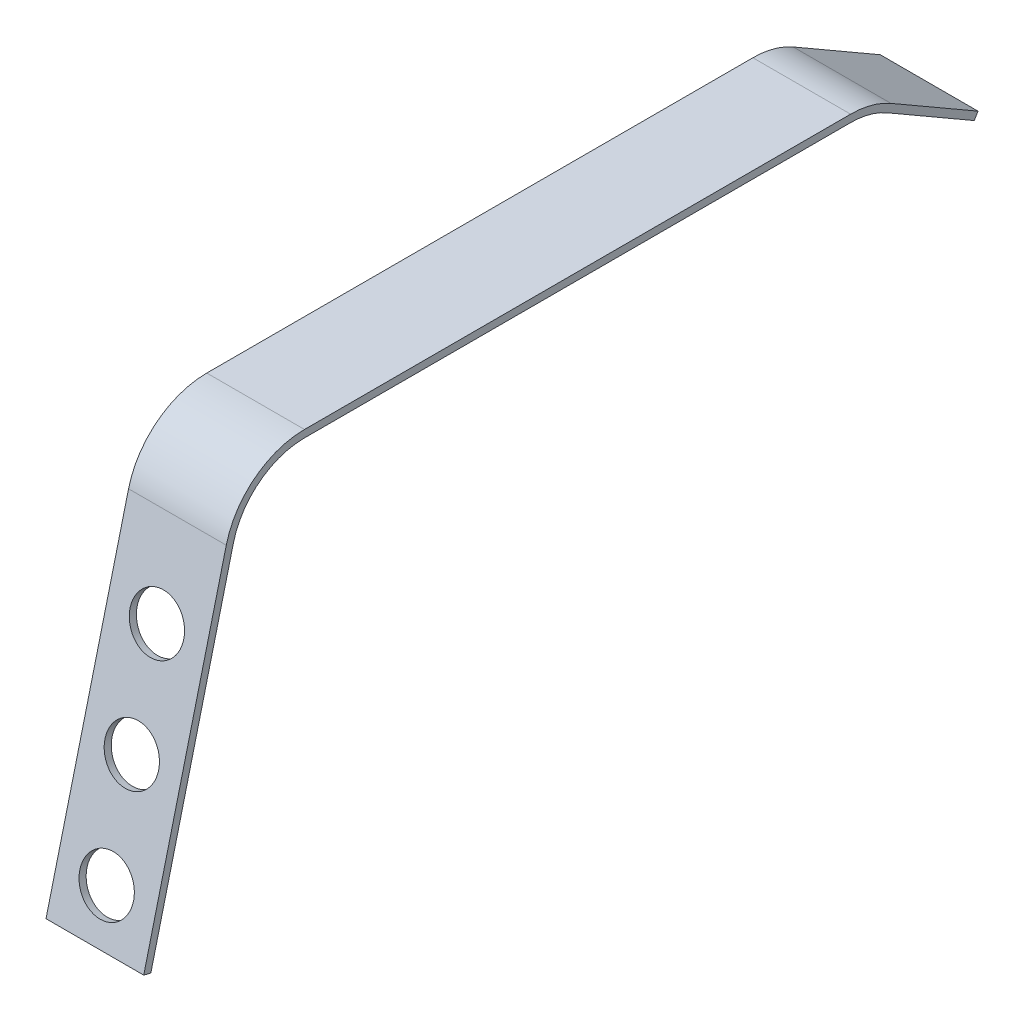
from build123d import *

# Parameters (mm, degrees)
EXTRUDE_5_DEPTH     = 4
SKETCH_11_R         = 1.1
CUT_EXTRUDE_6_DEPTH = 34.149511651
EXTRUDE_6_DEPTH     = 4
FILLET_6_R          = 3
FILLET_5_R          = 3.3
SKETCH_13_W         = 4.815621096
SKETCH_13_H         = 0.3
EXTRUDE_7_DEPTH     = 4
SKETCH_14_W         = 4.305758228
SKETCH_14_H         = 1.830785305
CUT_EXTRUDE_7_DEPTH = 35.133970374
EXTRUDE_12_DEPTH    = 4
CUT_EXTRUDE_8_DEPTH = 35.133970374


with BuildPart() as part:
    # Sketch 10 → Extrude 5 (new body)
    with BuildSketch(Plane(origin=(0, 0, 0), x_dir=(0, 0, -1), z_dir=(1, 0, 0))):
        with BuildLine():
            Line((-25.681090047, 0.539574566), (-29.817954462, -16.052482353))
            Line((-29.817954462, -16.052482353), (-29.526865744, -16.125058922))
            Line((-29.526865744, -16.125058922), (-25.390001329, 0.466997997))
            ThreePointArc((-25.390001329, 0.466997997), (-25.253424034, 0.651571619), (-25.026336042, 0.685510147))
            Line((-25.026336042, 0.685510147), (-21.145153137, -0.282177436))
            ThreePointArc((-21.145153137, -0.282177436), (-21.073121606, -0.295527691), (-21, -0.3))
            Line((-21, -0.3), (0, -0.3))
            Line((0, -0.3), (0, 0))
            Line((0, 0), (-21, 0))
            ThreePointArc((-21, 0), (-21.036560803, 0.002236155), (-21.072576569, 0.008911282))
            Line((-21.072576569, 0.008911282), (-24.953759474, 0.976598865))
            ThreePointArc((-24.953759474, 0.976598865), (-25.407935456, 0.908721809), (-25.681090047, 0.539574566))
        make_face()
    extrude(amount=EXTRUDE_5_DEPTH)

    # Sketch 11 → Cut-Extrude 6 (cut, through all)
    with BuildSketch(Plane(origin=(0, 6.05984999, 24.3047308), x_dir=(1, 0, 0), z_dir=(0, 0.24192189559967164, 0.9702957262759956))):
        with Locations(Location((2, -20.78927109, 0), (0, 0, 270))):
            Circle(SKETCH_11_R)
        with Locations(Location((2, -12.28927109, 0), (0, 0, 270))):
            Circle(SKETCH_11_R)
        with Locations(Location((2, -16.53927109, 0), (0, 0, 270))):
            Circle(SKETCH_11_R)
    extrude(amount=-CUT_EXTRUDE_6_DEPTH, mode=Mode.SUBTRACT)

    # Sketch 12 → Extrude 6 (add)
    with BuildSketch(Plane(origin=(4, 0, 0), x_dir=(0, 0, -1), z_dir=(1, 0, 0))):
        Polygon((0, 0), (4.330127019, -2.5), (4.180127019, -2.759807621), (-0.15, -0.259807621), align=None)
    extrude(amount=-EXTRUDE_6_DEPTH)

    # Fillet 6
    fillet_6_edges = [part.edges().sort_by_distance(p)[0] for p in [
        (2, -0.3, 0.080384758),
    ]]
    fillet(fillet_6_edges, radius=FILLET_6_R)

    # Fillet 5
    fillet_5_edges = [part.edges().sort_by_distance(p)[0] for p in [
        (2, 0, 0),
    ]]
    fillet(fillet_5_edges, radius=FILLET_5_R)

    # Sketch 13 → Extrude 7 (add)
    with BuildSketch(Plane(origin=(4, 0, 0), x_dir=(0, 0, -1), z_dir=(1, 0, 0))):
        with Locations((-23.407810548, -0.15)):
            Rectangle(SKETCH_13_W, SKETCH_13_H)
    extrude(amount=-EXTRUDE_7_DEPTH)

    # Sketch 14 → Cut-Extrude 7 (cut, through all)
    with BuildSketch(Plane(origin=(4, 0, 0), x_dir=(0, 0, -1), z_dir=(1, 0, 0))):
        with Locations((-23.152879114, 0.915392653)):
            Rectangle(SKETCH_14_W, SKETCH_14_H)
    extrude(amount=-CUT_EXTRUDE_7_DEPTH, mode=Mode.SUBTRACT)

    # Sketch 16 → Extrude 12 (add)
    with BuildSketch(Plane(origin=(4, 0, 0), x_dir=(0, 0, -1), z_dir=(1, 0, 0))):
        with BuildLine():
            Line((-26.148265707, -2.574234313), (-25.581235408, -0.3))
            Line((-25.581235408, -0.3), (-23.237378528, -0.3))
            ThreePointArc((-23.237378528, -0.3), (-25.084362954, -0.935967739), (-26.148265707, -2.574234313))
        make_face()
    extrude(amount=-EXTRUDE_12_DEPTH)

    # Sketch 17 → Cut-Extrude 8 (cut, through all)
    with BuildSketch(Plane(origin=(4, 0, 0), x_dir=(0, 0, -1), z_dir=(1, 0, 0))):
        with BuildLine():
            Line((-26.439354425, -2.501657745), (-26.440563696, -2.501657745))
            Line((-26.440563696, -2.501657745), (-26.440563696, 1.476219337))
            Line((-26.440563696, 1.476219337), (-23.237378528, 1.476219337))
            Line((-23.237378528, 1.476219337), (-23.237378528, 0))
            ThreePointArc((-23.237378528, 0), (-25.269061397, -0.699564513), (-26.439354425, -2.501657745))
        make_face()
    extrude(amount=-CUT_EXTRUDE_8_DEPTH, mode=Mode.SUBTRACT)


solid = part.part
